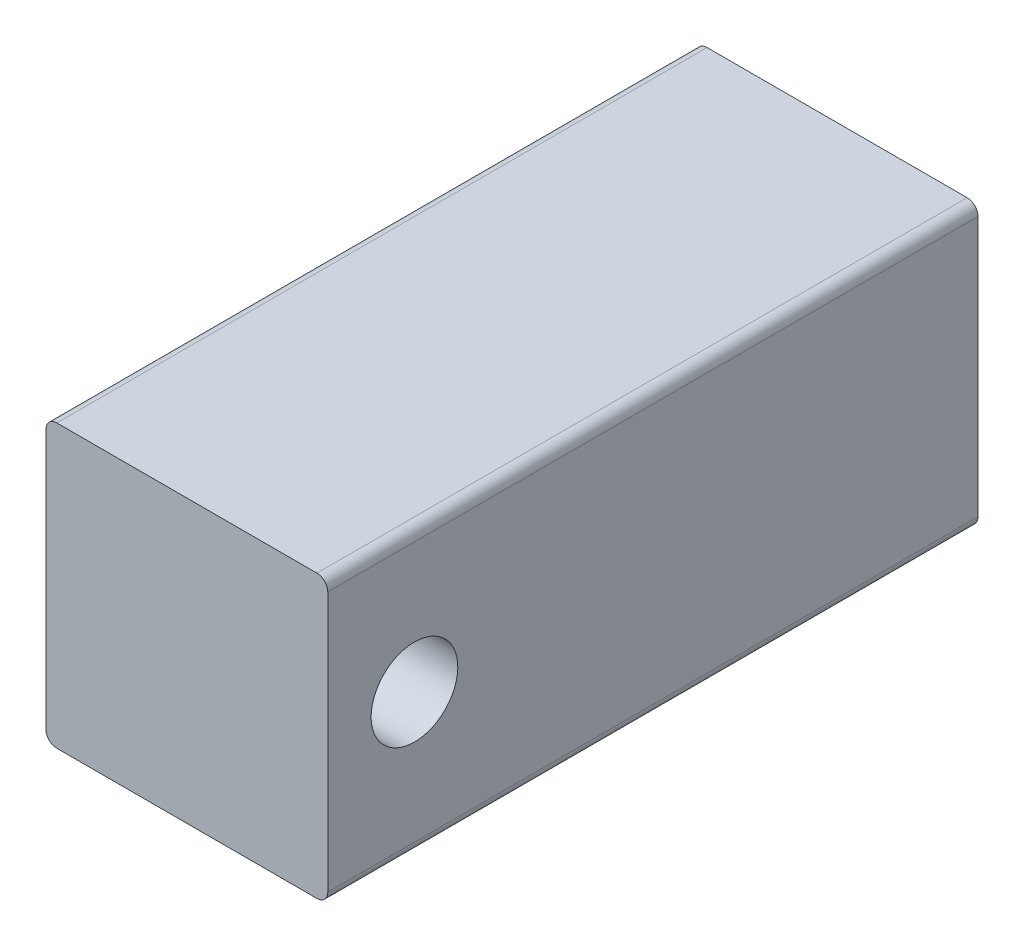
from build123d import *

# Parameters (mm, degrees)
BOSS_EXTRU_1_DEPTH      = 30
ESQUISSE2_R             = 2
ENL_V_MAT_EXTRU_1_DEPTH = 34.335416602
TROU_TARAUD_M41_D       = 3.3
TROU_TARAUD_M41_DEPTH   = 22
TROU_TARAUD_M41_TIP     = 0.991420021


with BuildPart() as part:
    # Esquisse1 → Boss.-Extru.1 (new body)
    with BuildSketch(Plane.XY):
        with BuildLine():
            Line((-6, 6.5), (6, 6.5))
            ThreePointArc((6, 6.5), (6.353553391, 6.353553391), (6.5, 6))
            Line((6.5, 6), (6.5, -6))
            ThreePointArc((6.5, -6), (6.353553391, -6.353553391), (6, -6.5))
            Line((6, -6.5), (-6, -6.5))
            ThreePointArc((-6, -6.5), (-6.353553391, -6.353553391), (-6.5, -6))
            Line((-6.5, -6), (-6.5, 6))
            ThreePointArc((-6.5, 6), (-6.353553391, 6.353553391), (-6, 6.5))
        make_face()
    extrude(amount=BOSS_EXTRU_1_DEPTH)

    # Esquisse2 → Enl_v. mat.-Extru.1 (cut, through all)
    with BuildSketch(Plane(origin=(6.5, 0, 0), x_dir=(0, 0, -1), z_dir=(1, 0, 0))):
        with Locations(Location((-26, 0, 0), (0, 0, 90))):
            Circle(ESQUISSE2_R)
    extrude(amount=-ENL_V_MAT_EXTRU_1_DEPTH, mode=Mode.SUBTRACT)

    # Trou taraud_ M41
    with Locations(Plane(origin=(0, 0, 0), x_dir=(-1, 0, 0), z_dir=(0, 0, -1))):
        with Locations((0, 0)):
            Hole(TROU_TARAUD_M41_D / 2, depth=TROU_TARAUD_M41_DEPTH)
            with Locations((0, 0, -(TROU_TARAUD_M41_DEPTH + TROU_TARAUD_M41_TIP / 2))):  # 118° drill point
                Cone(0, TROU_TARAUD_M41_D / 2, TROU_TARAUD_M41_TIP, mode=Mode.SUBTRACT)


solid = part.part
